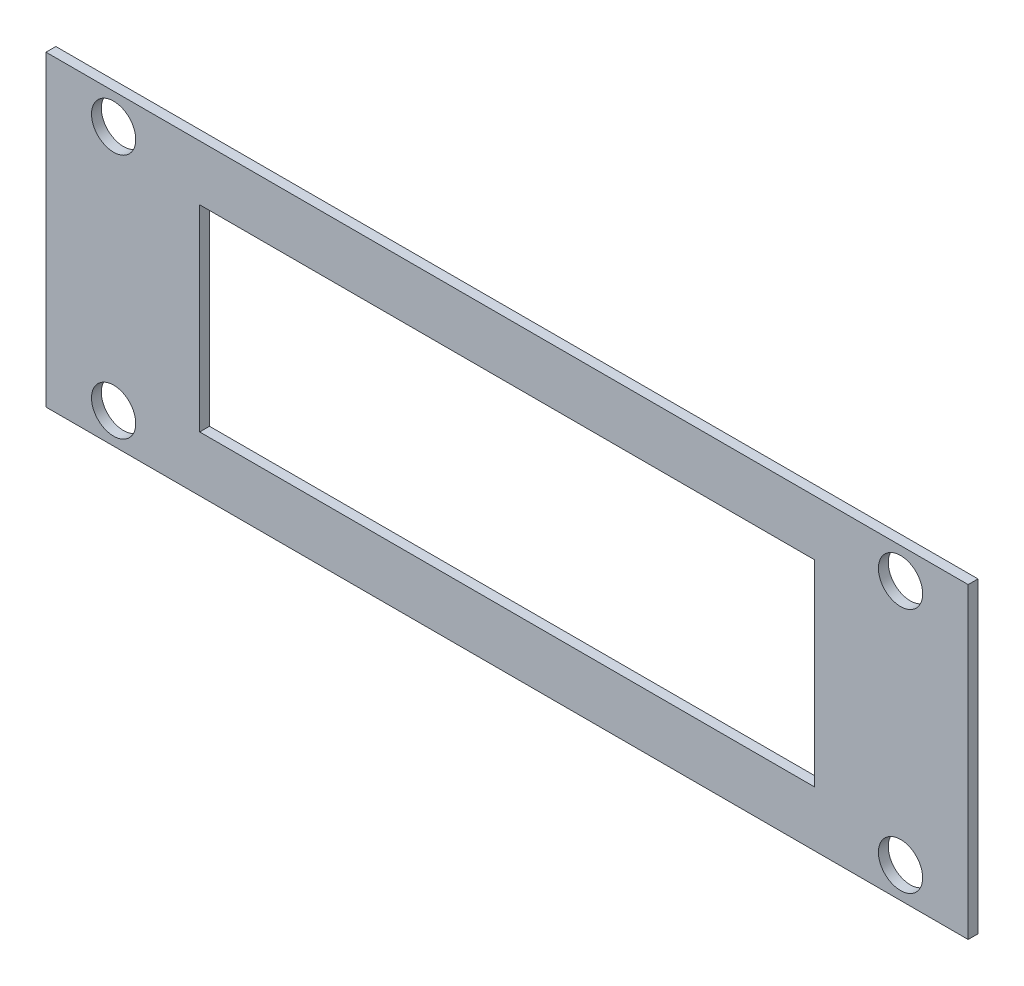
from build123d import *

# Parameters (mm, degrees)
SKETCH1_W      = 95.25
SKETCH1_H      = 31.75
SKETCH1_R      = 2.286
SKETCH1_W_2    = 63.5
SKETCH1_H_2    = 20.32
EXTRUDE1_DEPTH = 1.016


with BuildPart() as part:
    # Sketch1 → Extrude1 (new body)
    with BuildSketch(Plane.XY):
        Rectangle(SKETCH1_W, SKETCH1_H)
        with Locations((40.64, -12.7)):
            Circle(SKETCH1_R, mode=Mode.SUBTRACT)
        with Locations((40.64, 12.7)):
            Circle(SKETCH1_R, mode=Mode.SUBTRACT)
        with Locations((-40.64, 12.7)):
            Circle(SKETCH1_R, mode=Mode.SUBTRACT)
        with Locations((-40.64, -12.7)):
            Circle(SKETCH1_R, mode=Mode.SUBTRACT)
        Rectangle(SKETCH1_W_2, SKETCH1_H_2, mode=Mode.SUBTRACT)
    extrude(amount=EXTRUDE1_DEPTH)


solid = part.part
